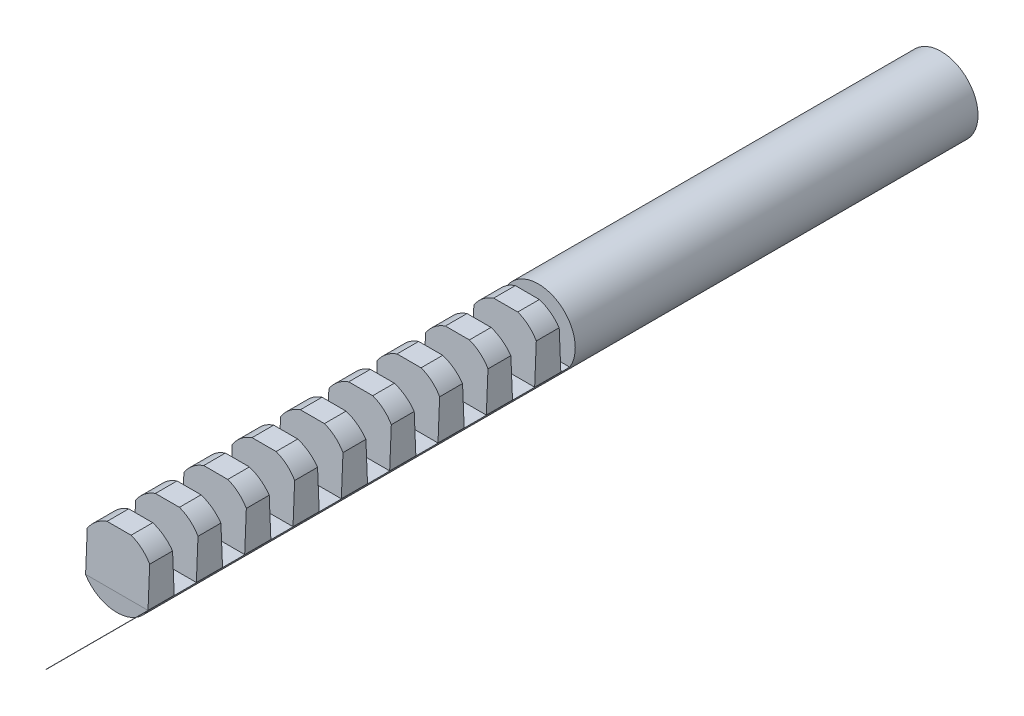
from build123d import *

# Parameters (mm, degrees)
BOSS_EXTRUDE1_DEPTH      = 20
BOSS_EXTRUDE1_DEPTH_BACK = 10
SKETCH1_R                = 2.75
BOSS_EXTRUDE2_DEPTH      = 39
BOSS_EXTRUDE3_DEPTH      = 2.325
CUT_EXTRUDE1_DEPTH       = 70.10951454
LPATTERN10_COUNT         = 10
LPATTERN10_PITCH         = 3.6
LPATTERN12_COUNT         = 2
LPATTERN12_PITCH         = 3.6
SKETCH6_W                = 4.661664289
SKETCH6_H                = 7.6
CUT_EXTRUDE2_DEPTH       = 10
SKETCH7_R                = 1.5
CUT_EXTRUDE3_DEPTH       = 20


with BuildPart() as part:
    # Sketch1 → Boss-Extrude1 (new, two sides: drawn at the far end of the back side and taken through both)
    with BuildSketch(Plane.XY.offset(-BOSS_EXTRUDE1_DEPTH_BACK)):
        Circle(SKETCH1_R)
    extrude(amount=BOSS_EXTRUDE1_DEPTH + BOSS_EXTRUDE1_DEPTH_BACK)

    # Sketch2 → Boss-Extrude2 (add)
    with BuildSketch(Plane.XY.offset(20)):
        with BuildLine():
            Line((-2.336664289, -1.45), (2.336664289, -1.45))
            ThreePointArc((2.336664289, -1.45), (0, -2.75), (-2.336664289, -1.45))
        make_face()
    extrude(amount=BOSS_EXTRUDE2_DEPTH)

    # Sketch4 → Boss-Extrude3 (add, symmetric)
    with BuildSketch(Plane(origin=(0, 0, 0), x_dir=(0, 0, -1), z_dir=(1, 0, 0))):
        Polygon((-53.05, -1.45), (-55, -1.45), (-54.83125, 2.6), (-53.21875, 2.6), align=None)
    boss_extrude3 = extrude(amount=BOSS_EXTRUDE3_DEPTH, both=True)

    # Sketch5 → Cut-Extrude1 (cut, symmetric)
    with BuildSketch(Plane.XY.offset(59)):
        with BuildLine():
            Line((-2.325, 1.468630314), (-2.325, 2.6))
            Line((-2.325, 2.6), (-0.895823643, 2.6))
            ThreePointArc((-0.895823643, 2.6), (-1.70687597, 2.156171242), (-2.325, 1.468630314))
        make_face()
        with BuildLine():
            Line((0.895823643, 2.6), (2.325, 2.6))
            Line((2.325, 2.6), (2.325, 1.468630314))
            ThreePointArc((2.325, 1.468630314), (1.70687597, 2.156171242), (0.895823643, 2.6))
        make_face()
    cut_extrude1 = extrude(amount=CUT_EXTRUDE1_DEPTH, both=True, mode=Mode.SUBTRACT)

    # LPattern10: Boss-Extrude3, Cut-Extrude1 ×10
    with Locations(*[(0, 0, -i * LPATTERN10_PITCH) for i in range(1, LPATTERN10_COUNT)]):
        add(boss_extrude3)
        add(cut_extrude1, mode=Mode.SUBTRACT)

    # LPattern12: Boss-Extrude3, Cut-Extrude1 ×2
    with Locations(*[(0, 0, i * LPATTERN12_PITCH) for i in range(1, LPATTERN12_COUNT)]):
        add(boss_extrude3)
        add(cut_extrude1, mode=Mode.SUBTRACT)

    # Sketch6 → Cut-Extrude2 (cut)
    with BuildSketch(Plane(origin=(0, 2.6, 0), x_dir=(1, 0, 0), z_dir=(0, 1, 0))):
        with Locations((-0.005832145, -55.2)):
            Rectangle(SKETCH6_W, SKETCH6_H)
    extrude(amount=-CUT_EXTRUDE2_DEPTH, mode=Mode.SUBTRACT)

    # Sketch7 → Cut-Extrude3 (cut)
    with BuildSketch(Plane(origin=(0, 0, -10), x_dir=(-1, 0, 0), z_dir=(0, 0, -1))):
        Circle(SKETCH7_R)
    extrude(amount=-CUT_EXTRUDE3_DEPTH, mode=Mode.SUBTRACT)


solid = part.part
